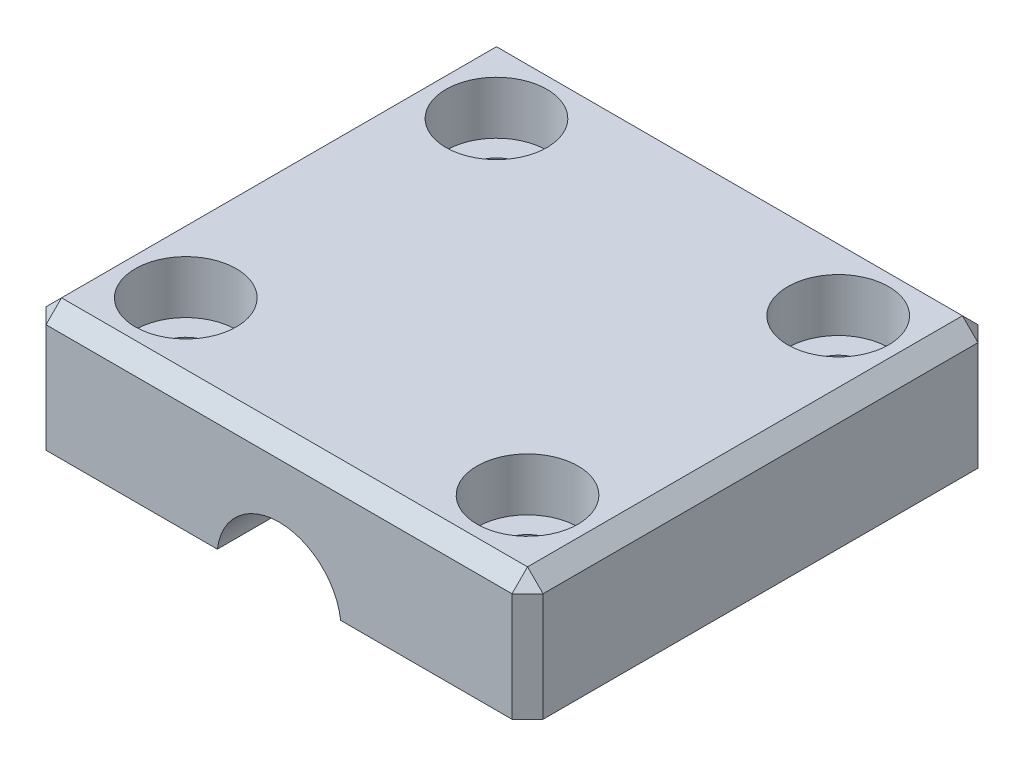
ISO-10303-21;
HEADER;
FILE_DESCRIPTION(('STEP AP214'),'2;1');
FILE_NAME('part.step','',(''),(''),'','','');
FILE_SCHEMA(('AUTOMOTIVE_DESIGN { 1 0 10303 214 1 1 1 1 }'));
ENDSEC;
DATA;
#1=APPLICATION_CONTEXT('core data for automotive mechanical design processes');
#2=APPLICATION_PROTOCOL_DEFINITION('international standard','automotive_design',2000,#1);
#3=PRODUCT_CONTEXT('',#1,'mechanical');
#4=PRODUCT('Part','Part','',(#3));
#5=PRODUCT_RELATED_PRODUCT_CATEGORY('part','',(#4));
#6=PRODUCT_DEFINITION_FORMATION('','',#4);
#7=PRODUCT_DEFINITION_CONTEXT('part definition',#1,'design');
#8=PRODUCT_DEFINITION('design','',#6,#7);
#9=PRODUCT_DEFINITION_SHAPE('','',#8);
#10=(LENGTH_UNIT() NAMED_UNIT(*) SI_UNIT(.MILLI.,.METRE.));
#11=(NAMED_UNIT(*) PLANE_ANGLE_UNIT() SI_UNIT($,.RADIAN.));
#12=(NAMED_UNIT(*) SI_UNIT($,.STERADIAN.) SOLID_ANGLE_UNIT());
#13=UNCERTAINTY_MEASURE_WITH_UNIT(LENGTH_MEASURE(1.E-05),#10,'distance_accuracy_value','');
#14=(GEOMETRIC_REPRESENTATION_CONTEXT(3) GLOBAL_UNCERTAINTY_ASSIGNED_CONTEXT((#13)) GLOBAL_UNIT_ASSIGNED_CONTEXT((#10,
#11,#12)) REPRESENTATION_CONTEXT('',''));
#15=CARTESIAN_POINT('',(0.,0.,0.));
#16=DIRECTION('',(0.,0.,1.));
#17=DIRECTION('',(1.,0.,0.));
#18=AXIS2_PLACEMENT_3D('',#15,#16,#17);
#19=CARTESIAN_POINT('',(0.,0.,0.));
#20=DIRECTION('',(0.,-1.,0.));
#21=DIRECTION('',(0.,0.,-1.));
#22=AXIS2_PLACEMENT_3D('',#19,#20,#21);
#23=PLANE('',#22);
#24=DIRECTION('',(-1.,0.,0.));
#25=VECTOR('',#24,1.);
#26=CARTESIAN_POINT('',(-16.,0.,-15.));
#27=LINE('',#26,#25);
#28=CARTESIAN_POINT('',(15.,0.,-15.));
#29=VERTEX_POINT('',#28);
#30=CARTESIAN_POINT('',(3.96862696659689,0.,-15.));
#31=VERTEX_POINT('',#30);
#32=EDGE_CURVE('E163',#29,#31,#27,.T.);
#33=ORIENTED_EDGE('',*,*,#32,.F.);
#34=DIRECTION('',(-0.707106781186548,0.,-0.707106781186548));
#35=VECTOR('',#34,1.);
#36=CARTESIAN_POINT('',(15.,0.,-15.));
#37=LINE('',#36,#35);
#38=CARTESIAN_POINT('',(16.,0.,-14.));
#39=VERTEX_POINT('',#38);
#40=EDGE_CURVE('E208',#29,#39,#37,.F.);
#41=ORIENTED_EDGE('',*,*,#40,.T.);
#42=DIRECTION('',(0.,0.,-1.));
#43=VECTOR('',#42,1.);
#44=CARTESIAN_POINT('',(16.,0.,15.));
#45=LINE('',#44,#43);
#46=CARTESIAN_POINT('',(16.,0.,14.));
#47=VERTEX_POINT('',#46);
#48=EDGE_CURVE('E334',#47,#39,#45,.T.);
#49=ORIENTED_EDGE('',*,*,#48,.F.);
#50=DIRECTION('',(0.707106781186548,0.,-0.707106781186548));
#51=VECTOR('',#50,1.);
#52=CARTESIAN_POINT('',(15.,0.,15.));
#53=LINE('',#52,#51);
#54=CARTESIAN_POINT('',(15.,0.,15.));
#55=VERTEX_POINT('',#54);
#56=EDGE_CURVE('E155',#47,#55,#53,.F.);
#57=ORIENTED_EDGE('',*,*,#56,.T.);
#58=DIRECTION('',(1.,0.,0.));
#59=VECTOR('',#58,1.);
#60=CARTESIAN_POINT('',(-16.,0.,15.));
#61=LINE('',#60,#59);
#62=CARTESIAN_POINT('',(3.96862696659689,0.,15.));
#63=VERTEX_POINT('',#62);
#64=EDGE_CURVE('E147',#63,#55,#61,.T.);
#65=ORIENTED_EDGE('',*,*,#64,.F.);
#66=DIRECTION('',(0.,0.,1.));
#67=VECTOR('',#66,1.);
#68=CARTESIAN_POINT('',(3.96862696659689,0.,-15.));
#69=LINE('',#68,#67);
#70=EDGE_CURVE('E132',#31,#63,#69,.T.);
#71=ORIENTED_EDGE('',*,*,#70,.F.);
#72=EDGE_LOOP('',(#33,#41,#49,#57,#65,#71));
#73=FACE_BOUND('',#72,.T.);
#74=CARTESIAN_POINT('',(11.,0.,10.));
#75=DIRECTION('',(0.,1.,0.));
#76=DIRECTION('',(0.,0.,1.));
#77=AXIS2_PLACEMENT_3D('',#74,#75,#76);
#78=CIRCLE('',#77,1.7);
#79=CARTESIAN_POINT('',(11.,0.,11.7));
#80=VERTEX_POINT('',#79);
#81=EDGE_CURVE('E356',#80,#80,#78,.T.);
#82=ORIENTED_EDGE('',*,*,#81,.T.);
#83=EDGE_LOOP('',(#82));
#84=FACE_BOUND('',#83,.T.);
#85=CARTESIAN_POINT('',(11.,0.,-10.));
#86=DIRECTION('',(0.,1.,0.));
#87=DIRECTION('',(0.,0.,1.));
#88=AXIS2_PLACEMENT_3D('',#85,#86,#87);
#89=CIRCLE('',#88,1.7);
#90=CARTESIAN_POINT('',(11.,0.,-8.3));
#91=VERTEX_POINT('',#90);
#92=EDGE_CURVE('E372',#91,#91,#89,.T.);
#93=ORIENTED_EDGE('',*,*,#92,.T.);
#94=EDGE_LOOP('',(#93));
#95=FACE_BOUND('',#94,.T.);
#96=ADVANCED_FACE('F41',(#73,#84,#95),#23,.T.);
#97=CARTESIAN_POINT('',(16.,8.,15.));
#98=DIRECTION('',(-1.,0.,0.));
#99=DIRECTION('',(0.,0.,1.));
#100=AXIS2_PLACEMENT_3D('',#97,#98,#99);
#101=PLANE('',#100);
#102=ORIENTED_EDGE('',*,*,#48,.T.);
#103=DIRECTION('',(0.,1.,0.));
#104=VECTOR('',#103,1.);
#105=CARTESIAN_POINT('',(16.,8.,-14.));
#106=LINE('',#105,#104);
#107=CARTESIAN_POINT('',(16.,7.,-14.));
#108=VERTEX_POINT('',#107);
#109=EDGE_CURVE('E217',#39,#108,#106,.T.);
#110=ORIENTED_EDGE('',*,*,#109,.T.);
#111=DIRECTION('',(0.,0.,1.));
#112=VECTOR('',#111,1.);
#113=CARTESIAN_POINT('',(16.,7.,15.));
#114=LINE('',#113,#112);
#115=CARTESIAN_POINT('',(16.,7.,14.));
#116=VERTEX_POINT('',#115);
#117=EDGE_CURVE('E214',#108,#116,#114,.T.);
#118=ORIENTED_EDGE('',*,*,#117,.T.);
#119=DIRECTION('',(0.,-1.,0.));
#120=VECTOR('',#119,1.);
#121=CARTESIAN_POINT('',(16.,8.,14.));
#122=LINE('',#121,#120);
#123=EDGE_CURVE('E211',#116,#47,#122,.T.);
#124=ORIENTED_EDGE('',*,*,#123,.T.);
#125=EDGE_LOOP('',(#102,#110,#118,#124));
#126=FACE_BOUND('',#125,.T.);
#127=ADVANCED_FACE('F297',(#126),#101,.F.);
#128=CARTESIAN_POINT('',(-16.,8.,-15.));
#129=DIRECTION('',(0.,0.,1.));
#130=DIRECTION('',(1.,0.,0.));
#131=AXIS2_PLACEMENT_3D('',#128,#129,#130);
#132=PLANE('',#131);
#133=CARTESIAN_POINT('',(-3.96862696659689,0.,-15.));
#134=VERTEX_POINT('',#133);
#135=CARTESIAN_POINT('',(-15.,0.,-15.));
#136=VERTEX_POINT('',#135);
#137=EDGE_CURVE('E332',#134,#136,#27,.T.);
#138=ORIENTED_EDGE('',*,*,#137,.T.);
#139=DIRECTION('',(0.,1.,0.));
#140=VECTOR('',#139,1.);
#141=CARTESIAN_POINT('',(-15.,8.,-15.));
#142=LINE('',#141,#140);
#143=CARTESIAN_POINT('',(-15.,7.,-15.));
#144=VERTEX_POINT('',#143);
#145=EDGE_CURVE('E203',#136,#144,#142,.T.);
#146=ORIENTED_EDGE('',*,*,#145,.T.);
#147=DIRECTION('',(1.,0.,0.));
#148=VECTOR('',#147,1.);
#149=CARTESIAN_POINT('',(-16.,7.,-15.));
#150=LINE('',#149,#148);
#151=CARTESIAN_POINT('',(15.,7.,-15.));
#152=VERTEX_POINT('',#151);
#153=EDGE_CURVE('E200',#144,#152,#150,.T.);
#154=ORIENTED_EDGE('',*,*,#153,.T.);
#155=DIRECTION('',(0.,-1.,0.));
#156=VECTOR('',#155,1.);
#157=CARTESIAN_POINT('',(15.,8.,-15.));
#158=LINE('',#157,#156);
#159=EDGE_CURVE('E197',#152,#29,#158,.T.);
#160=ORIENTED_EDGE('',*,*,#159,.T.);
#161=ORIENTED_EDGE('',*,*,#32,.T.);
#162=CARTESIAN_POINT('',(0.,-0.5,-15.));
#163=DIRECTION('',(0.,0.,1.));
#164=DIRECTION('',(1.,0.,0.));
#165=AXIS2_PLACEMENT_3D('',#162,#163,#164);
#166=CIRCLE('',#165,4.);
#167=EDGE_CURVE('E138',#31,#134,#166,.T.);
#168=ORIENTED_EDGE('',*,*,#167,.T.);
#169=EDGE_LOOP('',(#138,#146,#154,#160,#161,#168));
#170=FACE_BOUND('',#169,.T.);
#171=ADVANCED_FACE('F331',(#170),#132,.F.);
#172=CARTESIAN_POINT('',(-16.,8.,15.));
#173=DIRECTION('',(1.,0.,0.));
#174=DIRECTION('',(0.,0.,-1.));
#175=AXIS2_PLACEMENT_3D('',#172,#173,#174);
#176=PLANE('',#175);
#177=DIRECTION('',(0.,0.,-1.));
#178=VECTOR('',#177,1.);
#179=CARTESIAN_POINT('',(-16.,7.,15.));
#180=LINE('',#179,#178);
#181=CARTESIAN_POINT('',(-16.,7.,14.));
#182=VERTEX_POINT('',#181);
#183=CARTESIAN_POINT('',(-16.,7.,-14.));
#184=VERTEX_POINT('',#183);
#185=EDGE_CURVE('E184',#182,#184,#180,.T.);
#186=ORIENTED_EDGE('',*,*,#185,.T.);
#187=DIRECTION('',(0.,-1.,0.));
#188=VECTOR('',#187,1.);
#189=CARTESIAN_POINT('',(-16.,8.,-14.));
#190=LINE('',#189,#188);
#191=CARTESIAN_POINT('',(-16.,0.,-14.));
#192=VERTEX_POINT('',#191);
#193=EDGE_CURVE('E188',#184,#192,#190,.T.);
#194=ORIENTED_EDGE('',*,*,#193,.T.);
#195=DIRECTION('',(0.,0.,1.));
#196=VECTOR('',#195,1.);
#197=CARTESIAN_POINT('',(-16.,0.,15.));
#198=LINE('',#197,#196);
#199=CARTESIAN_POINT('',(-16.,0.,14.));
#200=VERTEX_POINT('',#199);
#201=EDGE_CURVE('E157',#192,#200,#198,.T.);
#202=ORIENTED_EDGE('',*,*,#201,.T.);
#203=DIRECTION('',(0.,1.,0.));
#204=VECTOR('',#203,1.);
#205=CARTESIAN_POINT('',(-16.,8.,14.));
#206=LINE('',#205,#204);
#207=EDGE_CURVE('E181',#200,#182,#206,.T.);
#208=ORIENTED_EDGE('',*,*,#207,.T.);
#209=EDGE_LOOP('',(#186,#194,#202,#208));
#210=FACE_BOUND('',#209,.T.);
#211=ADVANCED_FACE('F318',(#210),#176,.F.);
#212=CARTESIAN_POINT('',(-16.,8.,15.));
#213=DIRECTION('',(0.,0.,-1.));
#214=DIRECTION('',(-1.,0.,0.));
#215=AXIS2_PLACEMENT_3D('',#212,#213,#214);
#216=PLANE('',#215);
#217=ORIENTED_EDGE('',*,*,#64,.T.);
#218=DIRECTION('',(0.,1.,0.));
#219=VECTOR('',#218,1.);
#220=CARTESIAN_POINT('',(15.,8.,15.));
#221=LINE('',#220,#219);
#222=CARTESIAN_POINT('',(15.,7.,15.));
#223=VERTEX_POINT('',#222);
#224=EDGE_CURVE('E11',#55,#223,#221,.T.);
#225=ORIENTED_EDGE('',*,*,#224,.T.);
#226=DIRECTION('',(-1.,0.,0.));
#227=VECTOR('',#226,1.);
#228=CARTESIAN_POINT('',(-16.,7.,15.));
#229=LINE('',#228,#227);
#230=CARTESIAN_POINT('',(-15.,7.,15.));
#231=VERTEX_POINT('',#230);
#232=EDGE_CURVE('E52',#223,#231,#229,.T.);
#233=ORIENTED_EDGE('',*,*,#232,.T.);
#234=DIRECTION('',(0.,-1.,0.));
#235=VECTOR('',#234,1.);
#236=CARTESIAN_POINT('',(-15.,8.,15.));
#237=LINE('',#236,#235);
#238=CARTESIAN_POINT('',(-15.,0.,15.));
#239=VERTEX_POINT('',#238);
#240=EDGE_CURVE('E220',#231,#239,#237,.T.);
#241=ORIENTED_EDGE('',*,*,#240,.T.);
#242=CARTESIAN_POINT('',(-3.96862696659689,0.,15.));
#243=VERTEX_POINT('',#242);
#244=EDGE_CURVE('E149',#239,#243,#61,.T.);
#245=ORIENTED_EDGE('',*,*,#244,.T.);
#246=CARTESIAN_POINT('',(0.,-0.5,15.));
#247=DIRECTION('',(0.,0.,1.));
#248=DIRECTION('',(1.,0.,0.));
#249=AXIS2_PLACEMENT_3D('',#246,#247,#248);
#250=CIRCLE('',#249,4.);
#251=EDGE_CURVE('E135',#63,#243,#250,.T.);
#252=ORIENTED_EDGE('',*,*,#251,.F.);
#253=EDGE_LOOP('',(#217,#225,#233,#241,#245,#252));
#254=FACE_BOUND('',#253,.T.);
#255=ADVANCED_FACE('F146',(#254),#216,.F.);
#256=CARTESIAN_POINT('',(0.,8.,0.));
#257=DIRECTION('',(0.,-1.,0.));
#258=DIRECTION('',(0.,0.,-1.));
#259=AXIS2_PLACEMENT_3D('',#256,#257,#258);
#260=PLANE('',#259);
#261=DIRECTION('',(-1.,0.,0.));
#262=VECTOR('',#261,1.);
#263=CARTESIAN_POINT('',(0.,8.,-14.));
#264=LINE('',#263,#262);
#265=CARTESIAN_POINT('',(15.,8.,-14.));
#266=VERTEX_POINT('',#265);
#267=CARTESIAN_POINT('',(-15.,8.,-14.));
#268=VERTEX_POINT('',#267);
#269=EDGE_CURVE('E174',#266,#268,#264,.T.);
#270=ORIENTED_EDGE('',*,*,#269,.T.);
#271=DIRECTION('',(0.,0.,1.));
#272=VECTOR('',#271,1.);
#273=CARTESIAN_POINT('',(-15.,8.,0.));
#274=LINE('',#273,#272);
#275=CARTESIAN_POINT('',(-15.,8.,14.));
#276=VERTEX_POINT('',#275);
#277=EDGE_CURVE('E177',#268,#276,#274,.T.);
#278=ORIENTED_EDGE('',*,*,#277,.T.);
#279=DIRECTION('',(1.,0.,0.));
#280=VECTOR('',#279,1.);
#281=CARTESIAN_POINT('',(0.,8.,14.));
#282=LINE('',#281,#280);
#283=CARTESIAN_POINT('',(15.,8.,14.));
#284=VERTEX_POINT('',#283);
#285=EDGE_CURVE('E143',#276,#284,#282,.T.);
#286=ORIENTED_EDGE('',*,*,#285,.T.);
#287=DIRECTION('',(0.,0.,-1.));
#288=VECTOR('',#287,1.);
#289=CARTESIAN_POINT('',(15.,8.,0.));
#290=LINE('',#289,#288);
#291=EDGE_CURVE('E171',#284,#266,#290,.T.);
#292=ORIENTED_EDGE('',*,*,#291,.T.);
#293=EDGE_LOOP('',(#270,#278,#286,#292));
#294=FACE_BOUND('',#293,.T.);
#295=CARTESIAN_POINT('',(-11.,8.,-10.));
#296=DIRECTION('',(0.,1.,0.));
#297=DIRECTION('',(0.,0.,1.));
#298=AXIS2_PLACEMENT_3D('',#295,#296,#297);
#299=CIRCLE('',#298,3.25);
#300=CARTESIAN_POINT('',(-11.,8.,-6.75));
#301=VERTEX_POINT('',#300);
#302=EDGE_CURVE('E400',#301,#301,#299,.T.);
#303=ORIENTED_EDGE('',*,*,#302,.F.);
#304=EDGE_LOOP('',(#303));
#305=FACE_BOUND('',#304,.T.);
#306=CARTESIAN_POINT('',(11.,8.,-10.));
#307=DIRECTION('',(0.,1.,0.));
#308=DIRECTION('',(0.,0.,1.));
#309=AXIS2_PLACEMENT_3D('',#306,#307,#308);
#310=CIRCLE('',#309,3.25);
#311=CARTESIAN_POINT('',(11.,8.,-6.75));
#312=VERTEX_POINT('',#311);
#313=EDGE_CURVE('E384',#312,#312,#310,.T.);
#314=ORIENTED_EDGE('',*,*,#313,.F.);
#315=EDGE_LOOP('',(#314));
#316=FACE_BOUND('',#315,.T.);
#317=CARTESIAN_POINT('',(11.,8.,10.));
#318=DIRECTION('',(0.,1.,0.));
#319=DIRECTION('',(0.,0.,1.));
#320=AXIS2_PLACEMENT_3D('',#317,#318,#319);
#321=CIRCLE('',#320,3.25);
#322=CARTESIAN_POINT('',(11.,8.,13.25));
#323=VERTEX_POINT('',#322);
#324=EDGE_CURVE('E368',#323,#323,#321,.T.);
#325=ORIENTED_EDGE('',*,*,#324,.F.);
#326=EDGE_LOOP('',(#325));
#327=FACE_BOUND('',#326,.T.);
#328=CARTESIAN_POINT('',(-11.,8.,10.));
#329=DIRECTION('',(0.,1.,0.));
#330=DIRECTION('',(0.,0.,1.));
#331=AXIS2_PLACEMENT_3D('',#328,#329,#330);
#332=CIRCLE('',#331,3.25);
#333=CARTESIAN_POINT('',(-11.,8.,13.25));
#334=VERTEX_POINT('',#333);
#335=EDGE_CURVE('E352',#334,#334,#332,.T.);
#336=ORIENTED_EDGE('',*,*,#335,.F.);
#337=EDGE_LOOP('',(#336));
#338=FACE_BOUND('',#337,.T.);
#339=ADVANCED_FACE('F285',(#294,#305,#316,#327,#338),#260,.F.);
#340=ORIENTED_EDGE('',*,*,#201,.F.);
#341=DIRECTION('',(-0.707106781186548,0.,0.707106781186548));
#342=VECTOR('',#341,1.);
#343=CARTESIAN_POINT('',(-15.,0.,-15.));
#344=LINE('',#343,#342);
#345=EDGE_CURVE('E194',#192,#136,#344,.F.);
#346=ORIENTED_EDGE('',*,*,#345,.T.);
#347=ORIENTED_EDGE('',*,*,#137,.F.);
#348=DIRECTION('',(0.,0.,1.));
#349=VECTOR('',#348,1.);
#350=CARTESIAN_POINT('',(-3.96862696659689,0.,-15.));
#351=LINE('',#350,#349);
#352=EDGE_CURVE('E144',#243,#134,#351,.F.);
#353=ORIENTED_EDGE('',*,*,#352,.F.);
#354=ORIENTED_EDGE('',*,*,#244,.F.);
#355=DIRECTION('',(0.707106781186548,0.,0.707106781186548));
#356=VECTOR('',#355,1.);
#357=CARTESIAN_POINT('',(-15.,0.,15.));
#358=LINE('',#357,#356);
#359=EDGE_CURVE('E191',#239,#200,#358,.F.);
#360=ORIENTED_EDGE('',*,*,#359,.T.);
#361=EDGE_LOOP('',(#340,#346,#347,#353,#354,#360));
#362=FACE_BOUND('',#361,.T.);
#363=CARTESIAN_POINT('',(-11.,0.,-10.));
#364=DIRECTION('',(0.,1.,0.));
#365=DIRECTION('',(0.,0.,1.));
#366=AXIS2_PLACEMENT_3D('',#363,#364,#365);
#367=CIRCLE('',#366,1.7);
#368=CARTESIAN_POINT('',(-11.,0.,-8.3));
#369=VERTEX_POINT('',#368);
#370=EDGE_CURVE('E388',#369,#369,#367,.T.);
#371=ORIENTED_EDGE('',*,*,#370,.T.);
#372=EDGE_LOOP('',(#371));
#373=FACE_BOUND('',#372,.T.);
#374=CARTESIAN_POINT('',(-11.,0.,10.));
#375=DIRECTION('',(0.,1.,0.));
#376=DIRECTION('',(0.,0.,1.));
#377=AXIS2_PLACEMENT_3D('',#374,#375,#376);
#378=CIRCLE('',#377,1.7);
#379=CARTESIAN_POINT('',(-11.,0.,11.7));
#380=VERTEX_POINT('',#379);
#381=EDGE_CURVE('E338',#380,#380,#378,.T.);
#382=ORIENTED_EDGE('',*,*,#381,.T.);
#383=EDGE_LOOP('',(#382));
#384=FACE_BOUND('',#383,.T.);
#385=ADVANCED_FACE('F323',(#362,#373,#384),#23,.T.);
#386=CARTESIAN_POINT('',(-11.,8.,10.));
#387=DIRECTION('',(0.,1.,0.));
#388=DIRECTION('',(0.,0.,1.));
#389=AXIS2_PLACEMENT_3D('',#386,#387,#388);
#390=CYLINDRICAL_SURFACE('',#389,1.70000000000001);
#391=ORIENTED_EDGE('',*,*,#381,.F.);
#392=EDGE_LOOP('',(#391));
#393=FACE_BOUND('',#392,.T.);
#394=CARTESIAN_POINT('',(-11.,4.6,10.));
#395=DIRECTION('',(0.,1.,0.));
#396=DIRECTION('',(0.,0.,1.));
#397=AXIS2_PLACEMENT_3D('',#394,#395,#396);
#398=CIRCLE('',#397,1.70000000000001);
#399=CARTESIAN_POINT('',(-11.,4.6,11.7));
#400=VERTEX_POINT('',#399);
#401=EDGE_CURVE('E344',#400,#400,#398,.T.);
#402=ORIENTED_EDGE('',*,*,#401,.T.);
#403=EDGE_LOOP('',(#402));
#404=FACE_BOUND('',#403,.T.);
#405=ADVANCED_FACE('F449',(#393,#404),#390,.F.);
#406=CARTESIAN_POINT('',(-9.29999999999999,4.6,10.));
#407=DIRECTION('',(0.,-1.,0.));
#408=DIRECTION('',(0.,0.,-1.));
#409=AXIS2_PLACEMENT_3D('',#406,#407,#408);
#410=PLANE('',#409);
#411=ORIENTED_EDGE('',*,*,#401,.F.);
#412=EDGE_LOOP('',(#411));
#413=FACE_BOUND('',#412,.T.);
#414=CARTESIAN_POINT('',(-11.,4.6,10.));
#415=DIRECTION('',(0.,1.,0.));
#416=DIRECTION('',(0.,0.,1.));
#417=AXIS2_PLACEMENT_3D('',#414,#415,#416);
#418=CIRCLE('',#417,3.25);
#419=CARTESIAN_POINT('',(-11.,4.6,13.25));
#420=VERTEX_POINT('',#419);
#421=EDGE_CURVE('E348',#420,#420,#418,.T.);
#422=ORIENTED_EDGE('',*,*,#421,.T.);
#423=EDGE_LOOP('',(#422));
#424=FACE_BOUND('',#423,.T.);
#425=ADVANCED_FACE('F439',(#413,#424),#410,.F.);
#426=CARTESIAN_POINT('',(-11.,8.,10.));
#427=DIRECTION('',(0.,1.,0.));
#428=DIRECTION('',(0.,0.,1.));
#429=AXIS2_PLACEMENT_3D('',#426,#427,#428);
#430=CYLINDRICAL_SURFACE('',#429,3.25);
#431=ORIENTED_EDGE('',*,*,#421,.F.);
#432=EDGE_LOOP('',(#431));
#433=FACE_BOUND('',#432,.T.);
#434=ORIENTED_EDGE('',*,*,#335,.T.);
#435=EDGE_LOOP('',(#434));
#436=FACE_BOUND('',#435,.T.);
#437=ADVANCED_FACE('F436',(#433,#436),#430,.F.);
#438=CARTESIAN_POINT('',(11.,8.,10.));
#439=DIRECTION('',(0.,1.,0.));
#440=DIRECTION('',(0.,0.,1.));
#441=AXIS2_PLACEMENT_3D('',#438,#439,#440);
#442=CYLINDRICAL_SURFACE('',#441,1.70000000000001);
#443=ORIENTED_EDGE('',*,*,#81,.F.);
#444=EDGE_LOOP('',(#443));
#445=FACE_BOUND('',#444,.T.);
#446=CARTESIAN_POINT('',(11.,4.6,10.));
#447=DIRECTION('',(0.,1.,0.));
#448=DIRECTION('',(0.,0.,1.));
#449=AXIS2_PLACEMENT_3D('',#446,#447,#448);
#450=CIRCLE('',#449,1.70000000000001);
#451=CARTESIAN_POINT('',(11.,4.6,11.7));
#452=VERTEX_POINT('',#451);
#453=EDGE_CURVE('E360',#452,#452,#450,.T.);
#454=ORIENTED_EDGE('',*,*,#453,.T.);
#455=EDGE_LOOP('',(#454));
#456=FACE_BOUND('',#455,.T.);
#457=ADVANCED_FACE('F438',(#445,#456),#442,.F.);
#458=CARTESIAN_POINT('',(12.7,4.6,10.));
#459=DIRECTION('',(0.,-1.,0.));
#460=DIRECTION('',(0.,0.,-1.));
#461=AXIS2_PLACEMENT_3D('',#458,#459,#460);
#462=PLANE('',#461);
#463=ORIENTED_EDGE('',*,*,#453,.F.);
#464=EDGE_LOOP('',(#463));
#465=FACE_BOUND('',#464,.T.);
#466=CARTESIAN_POINT('',(11.,4.6,10.));
#467=DIRECTION('',(0.,1.,0.));
#468=DIRECTION('',(0.,0.,1.));
#469=AXIS2_PLACEMENT_3D('',#466,#467,#468);
#470=CIRCLE('',#469,3.25);
#471=CARTESIAN_POINT('',(11.,4.6,13.25));
#472=VERTEX_POINT('',#471);
#473=EDGE_CURVE('E364',#472,#472,#470,.T.);
#474=ORIENTED_EDGE('',*,*,#473,.T.);
#475=EDGE_LOOP('',(#474));
#476=FACE_BOUND('',#475,.T.);
#477=ADVANCED_FACE('F446',(#465,#476),#462,.F.);
#478=CARTESIAN_POINT('',(11.,8.,10.));
#479=DIRECTION('',(0.,1.,0.));
#480=DIRECTION('',(0.,0.,1.));
#481=AXIS2_PLACEMENT_3D('',#478,#479,#480);
#482=CYLINDRICAL_SURFACE('',#481,3.25);
#483=ORIENTED_EDGE('',*,*,#473,.F.);
#484=EDGE_LOOP('',(#483));
#485=FACE_BOUND('',#484,.T.);
#486=ORIENTED_EDGE('',*,*,#324,.T.);
#487=EDGE_LOOP('',(#486));
#488=FACE_BOUND('',#487,.T.);
#489=ADVANCED_FACE('F496',(#485,#488),#482,.F.);
#490=CARTESIAN_POINT('',(11.,8.,-10.));
#491=DIRECTION('',(0.,1.,0.));
#492=DIRECTION('',(0.,0.,1.));
#493=AXIS2_PLACEMENT_3D('',#490,#491,#492);
#494=CYLINDRICAL_SURFACE('',#493,1.70000000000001);
#495=ORIENTED_EDGE('',*,*,#92,.F.);
#496=EDGE_LOOP('',(#495));
#497=FACE_BOUND('',#496,.T.);
#498=CARTESIAN_POINT('',(11.,4.6,-10.));
#499=DIRECTION('',(0.,1.,0.));
#500=DIRECTION('',(0.,0.,1.));
#501=AXIS2_PLACEMENT_3D('',#498,#499,#500);
#502=CIRCLE('',#501,1.70000000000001);
#503=CARTESIAN_POINT('',(11.,4.6,-8.29999999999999));
#504=VERTEX_POINT('',#503);
#505=EDGE_CURVE('E376',#504,#504,#502,.T.);
#506=ORIENTED_EDGE('',*,*,#505,.T.);
#507=EDGE_LOOP('',(#506));
#508=FACE_BOUND('',#507,.T.);
#509=ADVANCED_FACE('F506',(#497,#508),#494,.F.);
#510=CARTESIAN_POINT('',(12.7,4.6,-10.));
#511=DIRECTION('',(0.,-1.,0.));
#512=DIRECTION('',(0.,0.,-1.));
#513=AXIS2_PLACEMENT_3D('',#510,#511,#512);
#514=PLANE('',#513);
#515=ORIENTED_EDGE('',*,*,#505,.F.);
#516=EDGE_LOOP('',(#515));
#517=FACE_BOUND('',#516,.T.);
#518=CARTESIAN_POINT('',(11.,4.6,-10.));
#519=DIRECTION('',(0.,1.,0.));
#520=DIRECTION('',(0.,0.,1.));
#521=AXIS2_PLACEMENT_3D('',#518,#519,#520);
#522=CIRCLE('',#521,3.25);
#523=CARTESIAN_POINT('',(11.,4.6,-6.75));
#524=VERTEX_POINT('',#523);
#525=EDGE_CURVE('E380',#524,#524,#522,.T.);
#526=ORIENTED_EDGE('',*,*,#525,.T.);
#527=EDGE_LOOP('',(#526));
#528=FACE_BOUND('',#527,.T.);
#529=ADVANCED_FACE('F516',(#517,#528),#514,.F.);
#530=CARTESIAN_POINT('',(11.,8.,-10.));
#531=DIRECTION('',(0.,1.,0.));
#532=DIRECTION('',(0.,0.,1.));
#533=AXIS2_PLACEMENT_3D('',#530,#531,#532);
#534=CYLINDRICAL_SURFACE('',#533,3.25);
#535=ORIENTED_EDGE('',*,*,#525,.F.);
#536=EDGE_LOOP('',(#535));
#537=FACE_BOUND('',#536,.T.);
#538=ORIENTED_EDGE('',*,*,#313,.T.);
#539=EDGE_LOOP('',(#538));
#540=FACE_BOUND('',#539,.T.);
#541=ADVANCED_FACE('F526',(#537,#540),#534,.F.);
#542=CARTESIAN_POINT('',(-11.,8.,-10.));
#543=DIRECTION('',(0.,1.,0.));
#544=DIRECTION('',(0.,0.,1.));
#545=AXIS2_PLACEMENT_3D('',#542,#543,#544);
#546=CYLINDRICAL_SURFACE('',#545,1.70000000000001);
#547=ORIENTED_EDGE('',*,*,#370,.F.);
#548=EDGE_LOOP('',(#547));
#549=FACE_BOUND('',#548,.T.);
#550=CARTESIAN_POINT('',(-11.,4.6,-10.));
#551=DIRECTION('',(0.,1.,0.));
#552=DIRECTION('',(0.,0.,1.));
#553=AXIS2_PLACEMENT_3D('',#550,#551,#552);
#554=CIRCLE('',#553,1.70000000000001);
#555=CARTESIAN_POINT('',(-11.,4.6,-8.29999999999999));
#556=VERTEX_POINT('',#555);
#557=EDGE_CURVE('E392',#556,#556,#554,.T.);
#558=ORIENTED_EDGE('',*,*,#557,.T.);
#559=EDGE_LOOP('',(#558));
#560=FACE_BOUND('',#559,.T.);
#561=ADVANCED_FACE('F536',(#549,#560),#546,.F.);
#562=CARTESIAN_POINT('',(-9.29999999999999,4.6,-10.));
#563=DIRECTION('',(0.,-1.,0.));
#564=DIRECTION('',(0.,0.,-1.));
#565=AXIS2_PLACEMENT_3D('',#562,#563,#564);
#566=PLANE('',#565);
#567=ORIENTED_EDGE('',*,*,#557,.F.);
#568=EDGE_LOOP('',(#567));
#569=FACE_BOUND('',#568,.T.);
#570=CARTESIAN_POINT('',(-11.,4.6,-10.));
#571=DIRECTION('',(0.,1.,0.));
#572=DIRECTION('',(0.,0.,1.));
#573=AXIS2_PLACEMENT_3D('',#570,#571,#572);
#574=CIRCLE('',#573,3.25);
#575=CARTESIAN_POINT('',(-11.,4.6,-6.75));
#576=VERTEX_POINT('',#575);
#577=EDGE_CURVE('E396',#576,#576,#574,.T.);
#578=ORIENTED_EDGE('',*,*,#577,.T.);
#579=EDGE_LOOP('',(#578));
#580=FACE_BOUND('',#579,.T.);
#581=ADVANCED_FACE('F546',(#569,#580),#566,.F.);
#582=CARTESIAN_POINT('',(-11.,8.,-10.));
#583=DIRECTION('',(0.,1.,0.));
#584=DIRECTION('',(0.,0.,1.));
#585=AXIS2_PLACEMENT_3D('',#582,#583,#584);
#586=CYLINDRICAL_SURFACE('',#585,3.25);
#587=ORIENTED_EDGE('',*,*,#577,.F.);
#588=EDGE_LOOP('',(#587));
#589=FACE_BOUND('',#588,.T.);
#590=ORIENTED_EDGE('',*,*,#302,.T.);
#591=EDGE_LOOP('',(#590));
#592=FACE_BOUND('',#591,.T.);
#593=ADVANCED_FACE('F426',(#589,#592),#586,.F.);
#594=CARTESIAN_POINT('',(0.,-0.5,-15.));
#595=DIRECTION('',(0.,0.,1.));
#596=DIRECTION('',(1.,0.,0.));
#597=AXIS2_PLACEMENT_3D('',#594,#595,#596);
#598=CYLINDRICAL_SURFACE('',#597,4.);
#599=ORIENTED_EDGE('',*,*,#70,.T.);
#600=ORIENTED_EDGE('',*,*,#251,.T.);
#601=ORIENTED_EDGE('',*,*,#352,.T.);
#602=ORIENTED_EDGE('',*,*,#167,.F.);
#603=EDGE_LOOP('',(#599,#600,#601,#602));
#604=FACE_BOUND('',#603,.T.);
#605=ADVANCED_FACE('F134',(#604),#598,.F.);
#606=CARTESIAN_POINT('',(15.,8.,-15.));
#607=DIRECTION('',(-0.707106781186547,0.,0.707106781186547));
#608=DIRECTION('',(0.,-1.,0.));
#609=AXIS2_PLACEMENT_3D('',#606,#607,#608);
#610=PLANE('',#609);
#611=ORIENTED_EDGE('',*,*,#40,.F.);
#612=ORIENTED_EDGE('',*,*,#159,.F.);
#613=DIRECTION('',(0.707106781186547,0.,0.707106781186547));
#614=VECTOR('',#613,1.);
#615=CARTESIAN_POINT('',(15.,7.,-15.));
#616=LINE('',#615,#614);
#617=EDGE_CURVE('E46',#108,#152,#616,.F.);
#618=ORIENTED_EDGE('',*,*,#617,.F.);
#619=ORIENTED_EDGE('',*,*,#109,.F.);
#620=EDGE_LOOP('',(#611,#612,#618,#619));
#621=FACE_BOUND('',#620,.T.);
#622=ADVANCED_FACE('F44',(#621),#610,.F.);
#623=CARTESIAN_POINT('',(15.,8.,0.));
#624=DIRECTION('',(-0.707106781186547,-0.707106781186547,0.));
#625=DIRECTION('',(0.,0.,-1.));
#626=AXIS2_PLACEMENT_3D('',#623,#624,#625);
#627=PLANE('',#626);
#628=DIRECTION('',(0.707106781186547,-0.707106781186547,0.));
#629=VECTOR('',#628,1.);
#630=CARTESIAN_POINT('',(16.,7.,14.));
#631=LINE('',#630,#629);
#632=EDGE_CURVE('E259',#116,#284,#631,.F.);
#633=ORIENTED_EDGE('',*,*,#632,.F.);
#634=ORIENTED_EDGE('',*,*,#117,.F.);
#635=DIRECTION('',(-0.707106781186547,0.707106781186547,0.));
#636=VECTOR('',#635,1.);
#637=CARTESIAN_POINT('',(15.5,7.5,-14.));
#638=LINE('',#637,#636);
#639=EDGE_CURVE('E262',#266,#108,#638,.F.);
#640=ORIENTED_EDGE('',*,*,#639,.F.);
#641=ORIENTED_EDGE('',*,*,#291,.F.);
#642=EDGE_LOOP('',(#633,#634,#640,#641));
#643=FACE_BOUND('',#642,.T.);
#644=ADVANCED_FACE('F293',(#643),#627,.F.);
#645=CARTESIAN_POINT('',(16.,8.,14.));
#646=DIRECTION('',(-0.707106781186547,0.,-0.707106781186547));
#647=DIRECTION('',(0.,-1.,0.));
#648=AXIS2_PLACEMENT_3D('',#645,#646,#647);
#649=PLANE('',#648);
#650=ORIENTED_EDGE('',*,*,#56,.F.);
#651=ORIENTED_EDGE('',*,*,#123,.F.);
#652=DIRECTION('',(-0.707106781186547,0.,0.707106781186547));
#653=VECTOR('',#652,1.);
#654=CARTESIAN_POINT('',(16.,7.,14.));
#655=LINE('',#654,#653);
#656=EDGE_CURVE('E255',#223,#116,#655,.F.);
#657=ORIENTED_EDGE('',*,*,#656,.F.);
#658=ORIENTED_EDGE('',*,*,#224,.F.);
#659=EDGE_LOOP('',(#650,#651,#657,#658));
#660=FACE_BOUND('',#659,.T.);
#661=ADVANCED_FACE('F299',(#660),#649,.F.);
#662=CARTESIAN_POINT('',(15.,7.,-15.));
#663=DIRECTION('',(0.577350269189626,0.577350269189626,-0.577350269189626));
#664=DIRECTION('',(-0.707106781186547,0.,-0.707106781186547));
#665=AXIS2_PLACEMENT_3D('',#662,#663,#664);
#666=PLANE('',#665);
#667=ORIENTED_EDGE('',*,*,#639,.T.);
#668=ORIENTED_EDGE('',*,*,#617,.T.);
#669=DIRECTION('',(0.,-0.707106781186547,-0.707106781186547));
#670=VECTOR('',#669,1.);
#671=CARTESIAN_POINT('',(15.,7.,-15.));
#672=LINE('',#671,#670);
#673=EDGE_CURVE('E251',#266,#152,#672,.T.);
#674=ORIENTED_EDGE('',*,*,#673,.F.);
#675=EDGE_LOOP('',(#667,#668,#674));
#676=FACE_BOUND('',#675,.T.);
#677=ADVANCED_FACE('F273',(#676),#666,.T.);
#678=CARTESIAN_POINT('',(16.,7.,14.));
#679=DIRECTION('',(0.577350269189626,0.577350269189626,0.577350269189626));
#680=DIRECTION('',(0.707106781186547,0.,-0.707106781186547));
#681=AXIS2_PLACEMENT_3D('',#678,#679,#680);
#682=PLANE('',#681);
#683=ORIENTED_EDGE('',*,*,#656,.T.);
#684=ORIENTED_EDGE('',*,*,#632,.T.);
#685=DIRECTION('',(0.,0.707106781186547,-0.707106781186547));
#686=VECTOR('',#685,1.);
#687=CARTESIAN_POINT('',(15.,7.5,14.5));
#688=LINE('',#687,#686);
#689=EDGE_CURVE('E247',#223,#284,#688,.T.);
#690=ORIENTED_EDGE('',*,*,#689,.F.);
#691=EDGE_LOOP('',(#683,#684,#690));
#692=FACE_BOUND('',#691,.T.);
#693=ADVANCED_FACE('F302',(#692),#682,.T.);
#694=CARTESIAN_POINT('',(-16.,8.,-14.));
#695=DIRECTION('',(0.707106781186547,0.,0.707106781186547));
#696=DIRECTION('',(0.,-1.,0.));
#697=AXIS2_PLACEMENT_3D('',#694,#695,#696);
#698=PLANE('',#697);
#699=ORIENTED_EDGE('',*,*,#345,.F.);
#700=ORIENTED_EDGE('',*,*,#193,.F.);
#701=DIRECTION('',(0.707106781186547,0.,-0.707106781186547));
#702=VECTOR('',#701,1.);
#703=CARTESIAN_POINT('',(-16.,7.,-14.));
#704=LINE('',#703,#702);
#705=EDGE_CURVE('E243',#144,#184,#704,.F.);
#706=ORIENTED_EDGE('',*,*,#705,.F.);
#707=ORIENTED_EDGE('',*,*,#145,.F.);
#708=EDGE_LOOP('',(#699,#700,#706,#707));
#709=FACE_BOUND('',#708,.T.);
#710=ADVANCED_FACE('F329',(#709),#698,.F.);
#711=CARTESIAN_POINT('',(0.,8.,-14.));
#712=DIRECTION('',(0.,-0.707106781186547,0.707106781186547));
#713=DIRECTION('',(-1.,0.,0.));
#714=AXIS2_PLACEMENT_3D('',#711,#712,#713);
#715=PLANE('',#714);
#716=ORIENTED_EDGE('',*,*,#673,.T.);
#717=ORIENTED_EDGE('',*,*,#153,.F.);
#718=DIRECTION('',(0.,0.707106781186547,0.707106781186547));
#719=VECTOR('',#718,1.);
#720=CARTESIAN_POINT('',(-15.,7.5,-14.5));
#721=LINE('',#720,#719);
#722=EDGE_CURVE('E239',#268,#144,#721,.F.);
#723=ORIENTED_EDGE('',*,*,#722,.F.);
#724=ORIENTED_EDGE('',*,*,#269,.F.);
#725=EDGE_LOOP('',(#716,#717,#723,#724));
#726=FACE_BOUND('',#725,.T.);
#727=ADVANCED_FACE('F280',(#726),#715,.F.);
#728=CARTESIAN_POINT('',(0.,8.,14.));
#729=DIRECTION('',(0.,-0.707106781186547,-0.707106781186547));
#730=DIRECTION('',(1.,0.,0.));
#731=AXIS2_PLACEMENT_3D('',#728,#729,#730);
#732=PLANE('',#731);
#733=ORIENTED_EDGE('',*,*,#689,.T.);
#734=ORIENTED_EDGE('',*,*,#285,.F.);
#735=DIRECTION('',(0.,-0.707106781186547,0.707106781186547));
#736=VECTOR('',#735,1.);
#737=CARTESIAN_POINT('',(-15.,8.,14.));
#738=LINE('',#737,#736);
#739=EDGE_CURVE('E235',#231,#276,#738,.F.);
#740=ORIENTED_EDGE('',*,*,#739,.F.);
#741=ORIENTED_EDGE('',*,*,#232,.F.);
#742=EDGE_LOOP('',(#733,#734,#740,#741));
#743=FACE_BOUND('',#742,.T.);
#744=ADVANCED_FACE('F305',(#743),#732,.F.);
#745=CARTESIAN_POINT('',(-15.,8.,15.));
#746=DIRECTION('',(0.707106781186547,0.,-0.707106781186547));
#747=DIRECTION('',(0.,-1.,0.));
#748=AXIS2_PLACEMENT_3D('',#745,#746,#747);
#749=PLANE('',#748);
#750=ORIENTED_EDGE('',*,*,#359,.F.);
#751=ORIENTED_EDGE('',*,*,#240,.F.);
#752=DIRECTION('',(-0.707106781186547,0.,-0.707106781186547));
#753=VECTOR('',#752,1.);
#754=CARTESIAN_POINT('',(-15.5,7.,14.5));
#755=LINE('',#754,#753);
#756=EDGE_CURVE('E231',#182,#231,#755,.F.);
#757=ORIENTED_EDGE('',*,*,#756,.F.);
#758=ORIENTED_EDGE('',*,*,#207,.F.);
#759=EDGE_LOOP('',(#750,#751,#757,#758));
#760=FACE_BOUND('',#759,.T.);
#761=ADVANCED_FACE('F314',(#760),#749,.F.);
#762=CARTESIAN_POINT('',(-16.,7.,-14.));
#763=DIRECTION('',(-0.577350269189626,0.577350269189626,-0.577350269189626));
#764=DIRECTION('',(-0.707106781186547,0.,0.707106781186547));
#765=AXIS2_PLACEMENT_3D('',#762,#763,#764);
#766=PLANE('',#765);
#767=ORIENTED_EDGE('',*,*,#722,.T.);
#768=ORIENTED_EDGE('',*,*,#705,.T.);
#769=DIRECTION('',(-0.707106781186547,-0.707106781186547,0.));
#770=VECTOR('',#769,1.);
#771=CARTESIAN_POINT('',(-16.,7.,-14.));
#772=LINE('',#771,#770);
#773=EDGE_CURVE('E228',#268,#184,#772,.T.);
#774=ORIENTED_EDGE('',*,*,#773,.F.);
#775=EDGE_LOOP('',(#767,#768,#774));
#776=FACE_BOUND('',#775,.T.);
#777=ADVANCED_FACE('F646',(#776),#766,.T.);
#778=CARTESIAN_POINT('',(-15.,8.,14.));
#779=DIRECTION('',(-0.577350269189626,0.577350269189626,0.577350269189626));
#780=DIRECTION('',(0.707106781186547,0.,0.707106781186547));
#781=AXIS2_PLACEMENT_3D('',#778,#779,#780);
#782=PLANE('',#781);
#783=ORIENTED_EDGE('',*,*,#756,.T.);
#784=ORIENTED_EDGE('',*,*,#739,.T.);
#785=DIRECTION('',(0.707106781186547,0.707106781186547,0.));
#786=VECTOR('',#785,1.);
#787=CARTESIAN_POINT('',(-15.,8.,14.));
#788=LINE('',#787,#786);
#789=EDGE_CURVE('E225',#182,#276,#788,.T.);
#790=ORIENTED_EDGE('',*,*,#789,.F.);
#791=EDGE_LOOP('',(#783,#784,#790));
#792=FACE_BOUND('',#791,.T.);
#793=ADVANCED_FACE('F309',(#792),#782,.T.);
#794=CARTESIAN_POINT('',(-15.,8.,0.));
#795=DIRECTION('',(0.707106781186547,-0.707106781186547,0.));
#796=DIRECTION('',(0.,0.,1.));
#797=AXIS2_PLACEMENT_3D('',#794,#795,#796);
#798=PLANE('',#797);
#799=ORIENTED_EDGE('',*,*,#773,.T.);
#800=ORIENTED_EDGE('',*,*,#185,.F.);
#801=ORIENTED_EDGE('',*,*,#789,.T.);
#802=ORIENTED_EDGE('',*,*,#277,.F.);
#803=EDGE_LOOP('',(#799,#800,#801,#802));
#804=FACE_BOUND('',#803,.T.);
#805=ADVANCED_FACE('F316',(#804),#798,.F.);
#806=CLOSED_SHELL('',(#96,#127,#171,#211,#255,#339,#385,#405,#425,#437,#457,#477,#489,#509,#529,
#541,#561,#581,#593,#605,#622,#644,#661,#677,#693,#710,#727,#744,#761,#777,#793,#805));
#807=MANIFOLD_SOLID_BREP('B2',#806);
#808=ADVANCED_BREP_SHAPE_REPRESENTATION('',(#18,#807),#14);
#809=SHAPE_DEFINITION_REPRESENTATION(#9,#808);
ENDSEC;
END-ISO-10303-21;
